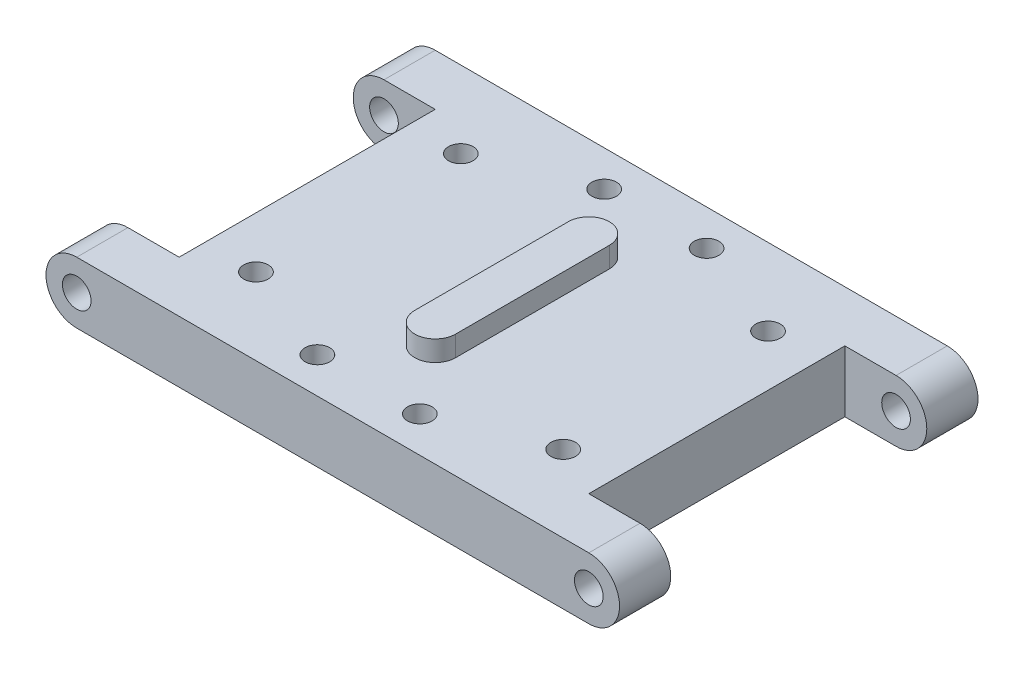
ISO-10303-21;
HEADER;
FILE_DESCRIPTION(('STEP AP214'),'2;1');
FILE_NAME('part.step','',(''),(''),'','','');
FILE_SCHEMA(('AUTOMOTIVE_DESIGN { 1 0 10303 214 1 1 1 1 }'));
ENDSEC;
DATA;
#1=APPLICATION_CONTEXT('core data for automotive mechanical design processes');
#2=APPLICATION_PROTOCOL_DEFINITION('international standard','automotive_design',2000,#1);
#3=PRODUCT_CONTEXT('',#1,'mechanical');
#4=PRODUCT('Part','Part','',(#3));
#5=PRODUCT_RELATED_PRODUCT_CATEGORY('part','',(#4));
#6=PRODUCT_DEFINITION_FORMATION('','',#4);
#7=PRODUCT_DEFINITION_CONTEXT('part definition',#1,'design');
#8=PRODUCT_DEFINITION('design','',#6,#7);
#9=PRODUCT_DEFINITION_SHAPE('','',#8);
#10=(LENGTH_UNIT() NAMED_UNIT(*) SI_UNIT(.MILLI.,.METRE.));
#11=(NAMED_UNIT(*) PLANE_ANGLE_UNIT() SI_UNIT($,.RADIAN.));
#12=(NAMED_UNIT(*) SI_UNIT($,.STERADIAN.) SOLID_ANGLE_UNIT());
#13=UNCERTAINTY_MEASURE_WITH_UNIT(LENGTH_MEASURE(1.E-05),#10,'distance_accuracy_value','');
#14=(GEOMETRIC_REPRESENTATION_CONTEXT(3) GLOBAL_UNCERTAINTY_ASSIGNED_CONTEXT((#13)) GLOBAL_UNIT_ASSIGNED_CONTEXT((#10,
#11,#12)) REPRESENTATION_CONTEXT('',''));
#15=CARTESIAN_POINT('',(0.,0.,0.));
#16=DIRECTION('',(0.,0.,1.));
#17=DIRECTION('',(1.,0.,0.));
#18=AXIS2_PLACEMENT_3D('',#15,#16,#17);
#19=CARTESIAN_POINT('',(-31.75,3.81000000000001,22.225));
#20=DIRECTION('',(0.,-1.,0.));
#21=DIRECTION('',(1.,0.,0.));
#22=AXIS2_PLACEMENT_3D('',#19,#20,#21);
#23=PLANE('',#22);
#24=CARTESIAN_POINT('',(-19.05,3.81000000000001,-12.7));
#25=DIRECTION('',(0.,-1.,0.));
#26=DIRECTION('',(1.,0.,0.));
#27=AXIS2_PLACEMENT_3D('',#24,#25,#26);
#28=CIRCLE('',#27,1.524);
#29=CARTESIAN_POINT('',(-17.526,3.81000000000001,-12.7));
#30=VERTEX_POINT('',#29);
#31=EDGE_CURVE('E869',#30,#30,#28,.T.);
#32=ORIENTED_EDGE('',*,*,#31,.T.);
#33=EDGE_LOOP('',(#32));
#34=FACE_BOUND('',#33,.T.);
#35=CARTESIAN_POINT('',(-19.05,3.81000000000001,12.7));
#36=DIRECTION('',(0.,-1.,0.));
#37=DIRECTION('',(1.,0.,0.));
#38=AXIS2_PLACEMENT_3D('',#35,#36,#37);
#39=CIRCLE('',#38,1.524);
#40=CARTESIAN_POINT('',(-17.526,3.81000000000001,12.7));
#41=VERTEX_POINT('',#40);
#42=EDGE_CURVE('E870',#41,#41,#39,.T.);
#43=ORIENTED_EDGE('',*,*,#42,.T.);
#44=EDGE_LOOP('',(#43));
#45=FACE_BOUND('',#44,.T.);
#46=CARTESIAN_POINT('',(19.05,3.81000000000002,12.7));
#47=DIRECTION('',(0.,-1.,0.));
#48=DIRECTION('',(1.,0.,0.));
#49=AXIS2_PLACEMENT_3D('',#46,#47,#48);
#50=CIRCLE('',#49,1.524);
#51=CARTESIAN_POINT('',(20.574,3.81000000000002,12.7));
#52=VERTEX_POINT('',#51);
#53=EDGE_CURVE('E874',#52,#52,#50,.T.);
#54=ORIENTED_EDGE('',*,*,#53,.T.);
#55=EDGE_LOOP('',(#54));
#56=FACE_BOUND('',#55,.T.);
#57=CARTESIAN_POINT('',(19.05,3.81000000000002,-12.7));
#58=DIRECTION('',(0.,-1.,0.));
#59=DIRECTION('',(1.,0.,0.));
#60=AXIS2_PLACEMENT_3D('',#57,#58,#59);
#61=CIRCLE('',#60,1.524);
#62=CARTESIAN_POINT('',(20.574,3.81000000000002,-12.7));
#63=VERTEX_POINT('',#62);
#64=EDGE_CURVE('E889',#63,#63,#61,.T.);
#65=ORIENTED_EDGE('',*,*,#64,.T.);
#66=EDGE_LOOP('',(#65));
#67=FACE_BOUND('',#66,.T.);
#68=DIRECTION('',(0.,0.,-1.));
#69=VECTOR('',#68,1.);
#70=CARTESIAN_POINT('',(-25.4,3.81000000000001,-15.875));
#71=LINE('',#70,#69);
#72=CARTESIAN_POINT('',(-25.4,3.81000000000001,15.875));
#73=VERTEX_POINT('',#72);
#74=CARTESIAN_POINT('',(-25.4,3.81000000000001,-15.875));
#75=VERTEX_POINT('',#74);
#76=EDGE_CURVE('E343',#73,#75,#71,.T.);
#77=ORIENTED_EDGE('',*,*,#76,.F.);
#78=DIRECTION('',(-1.,0.,0.));
#79=VECTOR('',#78,1.);
#80=CARTESIAN_POINT('',(-31.75,3.81000000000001,15.875));
#81=LINE('',#80,#79);
#82=CARTESIAN_POINT('',(-31.75,3.81000000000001,15.875));
#83=VERTEX_POINT('',#82);
#84=EDGE_CURVE('E11',#73,#83,#81,.T.);
#85=ORIENTED_EDGE('',*,*,#84,.T.);
#86=DIRECTION('',(0.,0.,-1.));
#87=VECTOR('',#86,1.);
#88=CARTESIAN_POINT('',(-31.75,3.81000000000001,22.225));
#89=LINE('',#88,#87);
#90=CARTESIAN_POINT('',(-31.75,3.81000000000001,22.225));
#91=VERTEX_POINT('',#90);
#92=EDGE_CURVE('E403',#91,#83,#89,.T.);
#93=ORIENTED_EDGE('',*,*,#92,.F.);
#94=DIRECTION('',(-1.,0.,0.));
#95=VECTOR('',#94,1.);
#96=CARTESIAN_POINT('',(-31.75,3.81000000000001,22.225));
#97=LINE('',#96,#95);
#98=CARTESIAN_POINT('',(31.75,3.81000000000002,22.225));
#99=VERTEX_POINT('',#98);
#100=EDGE_CURVE('E390',#99,#91,#97,.T.);
#101=ORIENTED_EDGE('',*,*,#100,.F.);
#102=DIRECTION('',(0.,0.,-1.));
#103=VECTOR('',#102,1.);
#104=CARTESIAN_POINT('',(31.75,3.81000000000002,22.225));
#105=LINE('',#104,#103);
#106=CARTESIAN_POINT('',(31.75,3.81000000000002,15.875));
#107=VERTEX_POINT('',#106);
#108=EDGE_CURVE('E407',#99,#107,#105,.T.);
#109=ORIENTED_EDGE('',*,*,#108,.T.);
#110=DIRECTION('',(1.,0.,0.));
#111=VECTOR('',#110,1.);
#112=CARTESIAN_POINT('',(45.72,3.81000000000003,15.875));
#113=LINE('',#112,#111);
#114=CARTESIAN_POINT('',(25.4,3.81000000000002,15.875));
#115=VERTEX_POINT('',#114);
#116=EDGE_CURVE('E357',#115,#107,#113,.T.);
#117=ORIENTED_EDGE('',*,*,#116,.F.);
#118=DIRECTION('',(0.,0.,1.));
#119=VECTOR('',#118,1.);
#120=CARTESIAN_POINT('',(25.4,3.81000000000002,-15.875));
#121=LINE('',#120,#119);
#122=CARTESIAN_POINT('',(25.4,3.81000000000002,-15.875));
#123=VERTEX_POINT('',#122);
#124=EDGE_CURVE('E295',#123,#115,#121,.T.);
#125=ORIENTED_EDGE('',*,*,#124,.F.);
#126=DIRECTION('',(1.,0.,0.));
#127=VECTOR('',#126,1.);
#128=CARTESIAN_POINT('',(-31.75,3.81000000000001,-15.875));
#129=LINE('',#128,#127);
#130=CARTESIAN_POINT('',(31.75,3.81000000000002,-15.875));
#131=VERTEX_POINT('',#130);
#132=EDGE_CURVE('E44',#123,#131,#129,.T.);
#133=ORIENTED_EDGE('',*,*,#132,.T.);
#134=CARTESIAN_POINT('',(31.75,3.81000000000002,-22.225));
#135=VERTEX_POINT('',#134);
#136=EDGE_CURVE('E406',#131,#135,#105,.T.);
#137=ORIENTED_EDGE('',*,*,#136,.T.);
#138=DIRECTION('',(-1.,0.,0.));
#139=VECTOR('',#138,1.);
#140=CARTESIAN_POINT('',(-31.75,3.81000000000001,-22.225));
#141=LINE('',#140,#139);
#142=CARTESIAN_POINT('',(-31.75,3.81000000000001,-22.225));
#143=VERTEX_POINT('',#142);
#144=EDGE_CURVE('E386',#135,#143,#141,.T.);
#145=ORIENTED_EDGE('',*,*,#144,.T.);
#146=CARTESIAN_POINT('',(-31.75,3.81000000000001,-15.875));
#147=VERTEX_POINT('',#146);
#148=EDGE_CURVE('E392',#147,#143,#89,.T.);
#149=ORIENTED_EDGE('',*,*,#148,.F.);
#150=DIRECTION('',(-1.,0.,0.));
#151=VECTOR('',#150,1.);
#152=CARTESIAN_POINT('',(-45.72,3.81000000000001,-15.875));
#153=LINE('',#152,#151);
#154=EDGE_CURVE('E336',#75,#147,#153,.T.);
#155=ORIENTED_EDGE('',*,*,#154,.F.);
#156=EDGE_LOOP('',(#77,#85,#93,#101,#109,#117,#125,#133,#137,#145,#149,#155));
#157=FACE_BOUND('',#156,.T.);
#158=CARTESIAN_POINT('',(-6.35,3.81000000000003,17.78));
#159=DIRECTION('',(0.,-1.,0.));
#160=DIRECTION('',(1.,0.,0.));
#161=AXIS2_PLACEMENT_3D('',#158,#159,#160);
#162=CIRCLE('',#161,1.524);
#163=CARTESIAN_POINT('',(-4.826,3.81000000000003,17.78));
#164=VERTEX_POINT('',#163);
#165=EDGE_CURVE('E262',#164,#164,#162,.T.);
#166=ORIENTED_EDGE('',*,*,#165,.T.);
#167=EDGE_LOOP('',(#166));
#168=FACE_BOUND('',#167,.T.);
#169=CARTESIAN_POINT('',(6.35,3.81000000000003,17.78));
#170=DIRECTION('',(0.,-1.,0.));
#171=DIRECTION('',(1.,0.,0.));
#172=AXIS2_PLACEMENT_3D('',#169,#170,#171);
#173=CIRCLE('',#172,1.524);
#174=CARTESIAN_POINT('',(7.874,3.81000000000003,17.78));
#175=VERTEX_POINT('',#174);
#176=EDGE_CURVE('E244',#175,#175,#173,.T.);
#177=ORIENTED_EDGE('',*,*,#176,.T.);
#178=EDGE_LOOP('',(#177));
#179=FACE_BOUND('',#178,.T.);
#180=CARTESIAN_POINT('',(6.34999999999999,3.81000000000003,-17.78));
#181=DIRECTION('',(0.,-1.,0.));
#182=DIRECTION('',(-1.,0.,0.));
#183=AXIS2_PLACEMENT_3D('',#180,#181,#182);
#184=CIRCLE('',#183,1.524);
#185=CARTESIAN_POINT('',(4.82599999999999,3.81000000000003,-17.78));
#186=VERTEX_POINT('',#185);
#187=EDGE_CURVE('E251',#186,#186,#184,.T.);
#188=ORIENTED_EDGE('',*,*,#187,.T.);
#189=EDGE_LOOP('',(#188));
#190=FACE_BOUND('',#189,.T.);
#191=CARTESIAN_POINT('',(-6.35,3.81000000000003,-17.78));
#192=DIRECTION('',(0.,-1.,0.));
#193=DIRECTION('',(-1.,0.,0.));
#194=AXIS2_PLACEMENT_3D('',#191,#192,#193);
#195=CIRCLE('',#194,1.524);
#196=CARTESIAN_POINT('',(-7.874,3.81000000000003,-17.78));
#197=VERTEX_POINT('',#196);
#198=EDGE_CURVE('E257',#197,#197,#195,.T.);
#199=ORIENTED_EDGE('',*,*,#198,.T.);
#200=EDGE_LOOP('',(#199));
#201=FACE_BOUND('',#200,.T.);
#202=CARTESIAN_POINT('',(0.,3.81000000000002,-9.525));
#203=DIRECTION('',(0.,1.,0.));
#204=DIRECTION('',(-1.,0.,0.));
#205=AXIS2_PLACEMENT_3D('',#202,#203,#204);
#206=CIRCLE('',#205,2.54);
#207=CARTESIAN_POINT('',(2.53999999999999,3.81000000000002,-9.525));
#208=VERTEX_POINT('',#207);
#209=CARTESIAN_POINT('',(-2.54,3.81000000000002,-9.525));
#210=VERTEX_POINT('',#209);
#211=EDGE_CURVE('E218',#208,#210,#206,.T.);
#212=ORIENTED_EDGE('',*,*,#211,.F.);
#213=DIRECTION('',(0.,0.,-1.));
#214=VECTOR('',#213,1.);
#215=CARTESIAN_POINT('',(2.53999999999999,3.81000000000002,-9.525));
#216=LINE('',#215,#214);
#217=CARTESIAN_POINT('',(2.54,3.81000000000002,9.525));
#218=VERTEX_POINT('',#217);
#219=EDGE_CURVE('E215',#218,#208,#216,.T.);
#220=ORIENTED_EDGE('',*,*,#219,.F.);
#221=CARTESIAN_POINT('',(0.,3.81000000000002,9.525));
#222=DIRECTION('',(0.,1.,0.));
#223=DIRECTION('',(-1.,0.,0.));
#224=AXIS2_PLACEMENT_3D('',#221,#222,#223);
#225=CIRCLE('',#224,2.54);
#226=CARTESIAN_POINT('',(-2.53999999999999,3.81000000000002,9.525));
#227=VERTEX_POINT('',#226);
#228=EDGE_CURVE('E57',#227,#218,#225,.T.);
#229=ORIENTED_EDGE('',*,*,#228,.F.);
#230=DIRECTION('',(0.,0.,1.));
#231=VECTOR('',#230,1.);
#232=CARTESIAN_POINT('',(-2.54,3.81000000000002,-9.525));
#233=LINE('',#232,#231);
#234=EDGE_CURVE('E52',#210,#227,#233,.T.);
#235=ORIENTED_EDGE('',*,*,#234,.F.);
#236=EDGE_LOOP('',(#212,#220,#229,#235));
#237=FACE_BOUND('',#236,.T.);
#238=ADVANCED_FACE('F35',(#34,#45,#56,#67,#157,#168,#179,#190,#201,#237),#23,.F.);
#239=CARTESIAN_POINT('',(-31.75,0.,22.225));
#240=DIRECTION('',(0.,0.,-1.));
#241=DIRECTION('',(-1.,0.,0.));
#242=AXIS2_PLACEMENT_3D('',#239,#240,#241);
#243=CYLINDRICAL_SURFACE('',#242,3.81000000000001);
#244=ORIENTED_EDGE('',*,*,#92,.T.);
#245=CARTESIAN_POINT('',(-31.75,0.,15.875));
#246=DIRECTION('',(0.,0.,1.));
#247=DIRECTION('',(1.,0.,0.));
#248=AXIS2_PLACEMENT_3D('',#245,#246,#247);
#249=CIRCLE('',#248,3.81000000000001);
#250=CARTESIAN_POINT('',(-31.75,-3.81000000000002,15.875));
#251=VERTEX_POINT('',#250);
#252=EDGE_CURVE('E378',#83,#251,#249,.T.);
#253=ORIENTED_EDGE('',*,*,#252,.T.);
#254=DIRECTION('',(0.,0.,-1.));
#255=VECTOR('',#254,1.);
#256=CARTESIAN_POINT('',(-31.75,-3.81000000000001,22.225));
#257=LINE('',#256,#255);
#258=CARTESIAN_POINT('',(-31.75,-3.81000000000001,22.225));
#259=VERTEX_POINT('',#258);
#260=EDGE_CURVE('E415',#259,#251,#257,.T.);
#261=ORIENTED_EDGE('',*,*,#260,.F.);
#262=CARTESIAN_POINT('',(-31.75,0.,22.225));
#263=DIRECTION('',(0.,0.,1.));
#264=DIRECTION('',(1.,0.,0.));
#265=AXIS2_PLACEMENT_3D('',#262,#263,#264);
#266=CIRCLE('',#265,3.81000000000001);
#267=EDGE_CURVE('E382',#91,#259,#266,.T.);
#268=ORIENTED_EDGE('',*,*,#267,.F.);
#269=EDGE_LOOP('',(#244,#253,#261,#268));
#270=FACE_BOUND('',#269,.T.);
#271=ADVANCED_FACE('F444',(#270),#243,.T.);
#272=CARTESIAN_POINT('',(31.75,0.,22.225));
#273=DIRECTION('',(0.,0.,-1.));
#274=DIRECTION('',(-1.,0.,0.));
#275=AXIS2_PLACEMENT_3D('',#272,#273,#274);
#276=CYLINDRICAL_SURFACE('',#275,3.81000000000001);
#277=DIRECTION('',(0.,0.,-1.));
#278=VECTOR('',#277,1.);
#279=CARTESIAN_POINT('',(31.75,-3.81000000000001,22.225));
#280=LINE('',#279,#278);
#281=CARTESIAN_POINT('',(31.75,-3.81000000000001,22.225));
#282=VERTEX_POINT('',#281);
#283=CARTESIAN_POINT('',(31.75,-3.81000000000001,15.875));
#284=VERTEX_POINT('',#283);
#285=EDGE_CURVE('E411',#282,#284,#280,.T.);
#286=ORIENTED_EDGE('',*,*,#285,.T.);
#287=CARTESIAN_POINT('',(31.75,0.,15.875));
#288=DIRECTION('',(0.,0.,1.));
#289=DIRECTION('',(1.,0.,0.));
#290=AXIS2_PLACEMENT_3D('',#287,#288,#289);
#291=CIRCLE('',#290,3.81000000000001);
#292=EDGE_CURVE('E372',#284,#107,#291,.T.);
#293=ORIENTED_EDGE('',*,*,#292,.T.);
#294=ORIENTED_EDGE('',*,*,#108,.F.);
#295=CARTESIAN_POINT('',(31.75,0.,22.225));
#296=DIRECTION('',(0.,0.,1.));
#297=DIRECTION('',(1.,0.,0.));
#298=AXIS2_PLACEMENT_3D('',#295,#296,#297);
#299=CIRCLE('',#298,3.81000000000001);
#300=EDGE_CURVE('E388',#282,#99,#299,.T.);
#301=ORIENTED_EDGE('',*,*,#300,.F.);
#302=EDGE_LOOP('',(#286,#293,#294,#301));
#303=FACE_BOUND('',#302,.T.);
#304=ADVANCED_FACE('F452',(#303),#276,.T.);
#305=CARTESIAN_POINT('',(-31.75,-3.81000000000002,-15.875));
#306=VERTEX_POINT('',#305);
#307=CARTESIAN_POINT('',(-31.75,-3.81000000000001,-22.225));
#308=VERTEX_POINT('',#307);
#309=EDGE_CURVE('E414',#306,#308,#257,.T.);
#310=ORIENTED_EDGE('',*,*,#309,.F.);
#311=CARTESIAN_POINT('',(-31.75,0.,-15.875));
#312=DIRECTION('',(0.,0.,-1.));
#313=DIRECTION('',(-1.,0.,0.));
#314=AXIS2_PLACEMENT_3D('',#311,#312,#313);
#315=CIRCLE('',#314,3.81000000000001);
#316=EDGE_CURVE('E375',#306,#147,#315,.T.);
#317=ORIENTED_EDGE('',*,*,#316,.T.);
#318=ORIENTED_EDGE('',*,*,#148,.T.);
#319=CARTESIAN_POINT('',(-31.75,0.,-22.225));
#320=DIRECTION('',(0.,0.,1.));
#321=DIRECTION('',(1.,0.,0.));
#322=AXIS2_PLACEMENT_3D('',#319,#320,#321);
#323=CIRCLE('',#322,3.81000000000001);
#324=EDGE_CURVE('E381',#143,#308,#323,.T.);
#325=ORIENTED_EDGE('',*,*,#324,.T.);
#326=EDGE_LOOP('',(#310,#317,#318,#325));
#327=FACE_BOUND('',#326,.T.);
#328=ADVANCED_FACE('F37',(#327),#243,.T.);
#329=CARTESIAN_POINT('',(-31.75,-3.81000000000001,22.225));
#330=DIRECTION('',(0.,1.,0.));
#331=DIRECTION('',(-1.,0.,0.));
#332=AXIS2_PLACEMENT_3D('',#329,#330,#331);
#333=PLANE('',#332);
#334=CARTESIAN_POINT('',(-19.05,-3.81000000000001,-12.7));
#335=DIRECTION('',(0.,-1.,0.));
#336=DIRECTION('',(-1.,0.,0.));
#337=AXIS2_PLACEMENT_3D('',#334,#335,#336);
#338=CIRCLE('',#337,1.524);
#339=CARTESIAN_POINT('',(-20.574,-3.81000000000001,-12.7));
#340=VERTEX_POINT('',#339);
#341=EDGE_CURVE('E474',#340,#340,#338,.T.);
#342=ORIENTED_EDGE('',*,*,#341,.F.);
#343=EDGE_LOOP('',(#342));
#344=FACE_BOUND('',#343,.T.);
#345=CARTESIAN_POINT('',(-19.05,-3.81000000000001,12.7));
#346=DIRECTION('',(0.,-1.,0.));
#347=DIRECTION('',(-1.,0.,0.));
#348=AXIS2_PLACEMENT_3D('',#345,#346,#347);
#349=CIRCLE('',#348,1.524);
#350=CARTESIAN_POINT('',(-20.574,-3.81000000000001,12.7));
#351=VERTEX_POINT('',#350);
#352=EDGE_CURVE('E478',#351,#351,#349,.T.);
#353=ORIENTED_EDGE('',*,*,#352,.F.);
#354=EDGE_LOOP('',(#353));
#355=FACE_BOUND('',#354,.T.);
#356=CARTESIAN_POINT('',(19.05,-3.81,12.7));
#357=DIRECTION('',(0.,-1.,0.));
#358=DIRECTION('',(1.,0.,0.));
#359=AXIS2_PLACEMENT_3D('',#356,#357,#358);
#360=CIRCLE('',#359,1.524);
#361=CARTESIAN_POINT('',(20.574,-3.81,12.7));
#362=VERTEX_POINT('',#361);
#363=EDGE_CURVE('E482',#362,#362,#360,.T.);
#364=ORIENTED_EDGE('',*,*,#363,.F.);
#365=EDGE_LOOP('',(#364));
#366=FACE_BOUND('',#365,.T.);
#367=CARTESIAN_POINT('',(19.05,-3.81,-12.7));
#368=DIRECTION('',(0.,-1.,0.));
#369=DIRECTION('',(1.,0.,0.));
#370=AXIS2_PLACEMENT_3D('',#367,#368,#369);
#371=CIRCLE('',#370,1.524);
#372=CARTESIAN_POINT('',(20.574,-3.81,-12.7));
#373=VERTEX_POINT('',#372);
#374=EDGE_CURVE('E486',#373,#373,#371,.T.);
#375=ORIENTED_EDGE('',*,*,#374,.F.);
#376=EDGE_LOOP('',(#375));
#377=FACE_BOUND('',#376,.T.);
#378=DIRECTION('',(1.,0.,0.));
#379=VECTOR('',#378,1.);
#380=CARTESIAN_POINT('',(-6.35,-3.81000000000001,15.24));
#381=LINE('',#380,#379);
#382=CARTESIAN_POINT('',(-6.35,-3.81000000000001,15.24));
#383=VERTEX_POINT('',#382);
#384=CARTESIAN_POINT('',(6.35,-3.81,15.24));
#385=VERTEX_POINT('',#384);
#386=EDGE_CURVE('E284',#383,#385,#381,.T.);
#387=ORIENTED_EDGE('',*,*,#386,.F.);
#388=CARTESIAN_POINT('',(-6.35,-3.81000000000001,17.78));
#389=DIRECTION('',(0.,-1.,0.));
#390=DIRECTION('',(1.,0.,0.));
#391=AXIS2_PLACEMENT_3D('',#388,#389,#390);
#392=CIRCLE('',#391,2.54000000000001);
#393=CARTESIAN_POINT('',(-6.35,-3.81000000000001,20.32));
#394=VERTEX_POINT('',#393);
#395=EDGE_CURVE('E282',#394,#383,#392,.T.);
#396=ORIENTED_EDGE('',*,*,#395,.F.);
#397=DIRECTION('',(-1.,0.,0.));
#398=VECTOR('',#397,1.);
#399=CARTESIAN_POINT('',(-6.35,-3.81000000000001,20.32));
#400=LINE('',#399,#398);
#401=CARTESIAN_POINT('',(6.35,-3.81,20.32));
#402=VERTEX_POINT('',#401);
#403=EDGE_CURVE('E272',#402,#394,#400,.T.);
#404=ORIENTED_EDGE('',*,*,#403,.F.);
#405=CARTESIAN_POINT('',(6.35,-3.81,17.78));
#406=DIRECTION('',(0.,-1.,0.));
#407=DIRECTION('',(1.,0.,0.));
#408=AXIS2_PLACEMENT_3D('',#405,#406,#407);
#409=CIRCLE('',#408,2.54000000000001);
#410=EDGE_CURVE('E288',#385,#402,#409,.T.);
#411=ORIENTED_EDGE('',*,*,#410,.F.);
#412=EDGE_LOOP('',(#387,#396,#404,#411));
#413=FACE_BOUND('',#412,.T.);
#414=DIRECTION('',(1.,0.,0.));
#415=VECTOR('',#414,1.);
#416=CARTESIAN_POINT('',(-6.34999999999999,-3.81000000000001,-20.32));
#417=LINE('',#416,#415);
#418=CARTESIAN_POINT('',(-6.34999999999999,-3.81000000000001,-20.32));
#419=VERTEX_POINT('',#418);
#420=CARTESIAN_POINT('',(6.35000000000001,-3.81,-20.32));
#421=VERTEX_POINT('',#420);
#422=EDGE_CURVE('E317',#419,#421,#417,.T.);
#423=ORIENTED_EDGE('',*,*,#422,.F.);
#424=CARTESIAN_POINT('',(-6.34999999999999,-3.81000000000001,-17.78));
#425=DIRECTION('',(0.,-1.,0.));
#426=DIRECTION('',(1.,0.,0.));
#427=AXIS2_PLACEMENT_3D('',#424,#425,#426);
#428=CIRCLE('',#427,2.54);
#429=CARTESIAN_POINT('',(-6.34999999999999,-3.81000000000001,-15.24));
#430=VERTEX_POINT('',#429);
#431=EDGE_CURVE('E265',#430,#419,#428,.T.);
#432=ORIENTED_EDGE('',*,*,#431,.F.);
#433=DIRECTION('',(-1.,0.,0.));
#434=VECTOR('',#433,1.);
#435=CARTESIAN_POINT('',(-6.34999999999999,-3.81000000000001,-15.24));
#436=LINE('',#435,#434);
#437=CARTESIAN_POINT('',(6.35000000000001,-3.81,-15.24));
#438=VERTEX_POINT('',#437);
#439=EDGE_CURVE('E306',#438,#430,#436,.T.);
#440=ORIENTED_EDGE('',*,*,#439,.F.);
#441=CARTESIAN_POINT('',(6.35000000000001,-3.81,-17.78));
#442=DIRECTION('',(0.,-1.,0.));
#443=DIRECTION('',(1.,0.,0.));
#444=AXIS2_PLACEMENT_3D('',#441,#442,#443);
#445=CIRCLE('',#444,2.54);
#446=EDGE_CURVE('E320',#421,#438,#445,.T.);
#447=ORIENTED_EDGE('',*,*,#446,.F.);
#448=EDGE_LOOP('',(#423,#432,#440,#447));
#449=FACE_BOUND('',#448,.T.);
#450=ORIENTED_EDGE('',*,*,#260,.T.);
#451=DIRECTION('',(1.,0.,0.));
#452=VECTOR('',#451,1.);
#453=CARTESIAN_POINT('',(-45.72,-3.81000000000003,15.875));
#454=LINE('',#453,#452);
#455=CARTESIAN_POINT('',(-25.4,-3.81000000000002,15.875));
#456=VERTEX_POINT('',#455);
#457=EDGE_CURVE('E339',#251,#456,#454,.T.);
#458=ORIENTED_EDGE('',*,*,#457,.T.);
#459=DIRECTION('',(0.,0.,-1.));
#460=VECTOR('',#459,1.);
#461=CARTESIAN_POINT('',(-25.4,-3.81000000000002,-15.875));
#462=LINE('',#461,#460);
#463=CARTESIAN_POINT('',(-25.4,-3.81000000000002,-15.875));
#464=VERTEX_POINT('',#463);
#465=EDGE_CURVE('E332',#456,#464,#462,.T.);
#466=ORIENTED_EDGE('',*,*,#465,.T.);
#467=DIRECTION('',(-1.,0.,0.));
#468=VECTOR('',#467,1.);
#469=CARTESIAN_POINT('',(-45.72,-3.81000000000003,-15.875));
#470=LINE('',#469,#468);
#471=EDGE_CURVE('E335',#464,#306,#470,.T.);
#472=ORIENTED_EDGE('',*,*,#471,.T.);
#473=ORIENTED_EDGE('',*,*,#309,.T.);
#474=DIRECTION('',(1.,0.,0.));
#475=VECTOR('',#474,1.);
#476=CARTESIAN_POINT('',(-31.75,-3.81000000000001,-22.225));
#477=LINE('',#476,#475);
#478=CARTESIAN_POINT('',(31.75,-3.81000000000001,-22.225));
#479=VERTEX_POINT('',#478);
#480=EDGE_CURVE('E395',#308,#479,#477,.T.);
#481=ORIENTED_EDGE('',*,*,#480,.T.);
#482=CARTESIAN_POINT('',(31.75,-3.81000000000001,-15.875));
#483=VERTEX_POINT('',#482);
#484=EDGE_CURVE('E410',#483,#479,#280,.T.);
#485=ORIENTED_EDGE('',*,*,#484,.F.);
#486=DIRECTION('',(-1.,0.,0.));
#487=VECTOR('',#486,1.);
#488=CARTESIAN_POINT('',(45.72,-3.81000000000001,-15.875));
#489=LINE('',#488,#487);
#490=CARTESIAN_POINT('',(25.4,-3.81000000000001,-15.875));
#491=VERTEX_POINT('',#490);
#492=EDGE_CURVE('E353',#483,#491,#489,.T.);
#493=ORIENTED_EDGE('',*,*,#492,.T.);
#494=DIRECTION('',(0.,0.,1.));
#495=VECTOR('',#494,1.);
#496=CARTESIAN_POINT('',(25.4,-3.81000000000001,-15.875));
#497=LINE('',#496,#495);
#498=CARTESIAN_POINT('',(25.4,-3.81000000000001,15.875));
#499=VERTEX_POINT('',#498);
#500=EDGE_CURVE('E356',#491,#499,#497,.T.);
#501=ORIENTED_EDGE('',*,*,#500,.T.);
#502=DIRECTION('',(1.,0.,0.));
#503=VECTOR('',#502,1.);
#504=CARTESIAN_POINT('',(45.72,-3.81000000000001,15.875));
#505=LINE('',#504,#503);
#506=EDGE_CURVE('E360',#499,#284,#505,.T.);
#507=ORIENTED_EDGE('',*,*,#506,.T.);
#508=ORIENTED_EDGE('',*,*,#285,.F.);
#509=DIRECTION('',(1.,0.,0.));
#510=VECTOR('',#509,1.);
#511=CARTESIAN_POINT('',(-31.75,-3.81000000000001,22.225));
#512=LINE('',#511,#510);
#513=EDGE_CURVE('E385',#259,#282,#512,.T.);
#514=ORIENTED_EDGE('',*,*,#513,.F.);
#515=EDGE_LOOP('',(#450,#458,#466,#472,#473,#481,#485,#493,#501,#507,#508,#514));
#516=FACE_BOUND('',#515,.T.);
#517=ADVANCED_FACE('F463',(#344,#355,#366,#377,#413,#449,#516),#333,.F.);
#518=ORIENTED_EDGE('',*,*,#136,.F.);
#519=CARTESIAN_POINT('',(31.75,0.,-15.875));
#520=DIRECTION('',(0.,0.,-1.));
#521=DIRECTION('',(-1.,0.,0.));
#522=AXIS2_PLACEMENT_3D('',#519,#520,#521);
#523=CIRCLE('',#522,3.81000000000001);
#524=EDGE_CURVE('E350',#131,#483,#523,.T.);
#525=ORIENTED_EDGE('',*,*,#524,.T.);
#526=ORIENTED_EDGE('',*,*,#484,.T.);
#527=CARTESIAN_POINT('',(31.75,0.,-22.225));
#528=DIRECTION('',(0.,0.,1.));
#529=DIRECTION('',(1.,0.,0.));
#530=AXIS2_PLACEMENT_3D('',#527,#528,#529);
#531=CIRCLE('',#530,3.81000000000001);
#532=EDGE_CURVE('E398',#479,#135,#531,.T.);
#533=ORIENTED_EDGE('',*,*,#532,.T.);
#534=EDGE_LOOP('',(#518,#525,#526,#533));
#535=FACE_BOUND('',#534,.T.);
#536=ADVANCED_FACE('F460',(#535),#276,.T.);
#537=CARTESIAN_POINT('',(-31.75,0.,22.225));
#538=DIRECTION('',(0.,0.,1.));
#539=DIRECTION('',(1.,0.,0.));
#540=AXIS2_PLACEMENT_3D('',#537,#538,#539);
#541=PLANE('',#540);
#542=CARTESIAN_POINT('',(-31.75,0.,22.225));
#543=DIRECTION('',(0.,0.,1.));
#544=DIRECTION('',(1.,0.,0.));
#545=AXIS2_PLACEMENT_3D('',#542,#543,#544);
#546=CIRCLE('',#545,1.778);
#547=CARTESIAN_POINT('',(-29.972,0.,22.225));
#548=VERTEX_POINT('',#547);
#549=EDGE_CURVE('E232',#548,#548,#546,.T.);
#550=ORIENTED_EDGE('',*,*,#549,.F.);
#551=EDGE_LOOP('',(#550));
#552=FACE_BOUND('',#551,.T.);
#553=CARTESIAN_POINT('',(31.75,0.,22.225));
#554=DIRECTION('',(0.,0.,1.));
#555=DIRECTION('',(1.,0.,0.));
#556=AXIS2_PLACEMENT_3D('',#553,#554,#555);
#557=CIRCLE('',#556,1.778);
#558=CARTESIAN_POINT('',(33.528,0.,22.225));
#559=VERTEX_POINT('',#558);
#560=EDGE_CURVE('E219',#559,#559,#557,.T.);
#561=ORIENTED_EDGE('',*,*,#560,.F.);
#562=EDGE_LOOP('',(#561));
#563=FACE_BOUND('',#562,.T.);
#564=ORIENTED_EDGE('',*,*,#267,.T.);
#565=ORIENTED_EDGE('',*,*,#513,.T.);
#566=ORIENTED_EDGE('',*,*,#300,.T.);
#567=ORIENTED_EDGE('',*,*,#100,.T.);
#568=EDGE_LOOP('',(#564,#565,#566,#567));
#569=FACE_BOUND('',#568,.T.);
#570=ADVANCED_FACE('F462',(#552,#563,#569),#541,.T.);
#571=CARTESIAN_POINT('',(-31.75,0.,-22.225));
#572=DIRECTION('',(0.,0.,1.));
#573=DIRECTION('',(1.,0.,0.));
#574=AXIS2_PLACEMENT_3D('',#571,#572,#573);
#575=PLANE('',#574);
#576=CARTESIAN_POINT('',(-31.75,0.,-22.225));
#577=DIRECTION('',(0.,0.,1.));
#578=DIRECTION('',(1.,0.,0.));
#579=AXIS2_PLACEMENT_3D('',#576,#577,#578);
#580=CIRCLE('',#579,1.778);
#581=CARTESIAN_POINT('',(-29.972,0.,-22.225));
#582=VERTEX_POINT('',#581);
#583=EDGE_CURVE('E228',#582,#582,#580,.T.);
#584=ORIENTED_EDGE('',*,*,#583,.T.);
#585=EDGE_LOOP('',(#584));
#586=FACE_BOUND('',#585,.T.);
#587=CARTESIAN_POINT('',(31.75,0.,-22.225));
#588=DIRECTION('',(0.,0.,1.));
#589=DIRECTION('',(1.,0.,0.));
#590=AXIS2_PLACEMENT_3D('',#587,#588,#589);
#591=CIRCLE('',#590,1.778);
#592=CARTESIAN_POINT('',(33.528,0.,-22.225));
#593=VERTEX_POINT('',#592);
#594=EDGE_CURVE('E222',#593,#593,#591,.T.);
#595=ORIENTED_EDGE('',*,*,#594,.T.);
#596=EDGE_LOOP('',(#595));
#597=FACE_BOUND('',#596,.T.);
#598=ORIENTED_EDGE('',*,*,#324,.F.);
#599=ORIENTED_EDGE('',*,*,#144,.F.);
#600=ORIENTED_EDGE('',*,*,#532,.F.);
#601=ORIENTED_EDGE('',*,*,#480,.F.);
#602=EDGE_LOOP('',(#598,#599,#600,#601));
#603=FACE_BOUND('',#602,.T.);
#604=ADVANCED_FACE('F458',(#586,#597,#603),#575,.F.);
#605=CARTESIAN_POINT('',(45.72,-3.81000000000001,15.875));
#606=DIRECTION('',(0.,0.,1.));
#607=DIRECTION('',(1.,0.,0.));
#608=AXIS2_PLACEMENT_3D('',#605,#606,#607);
#609=PLANE('',#608);
#610=CARTESIAN_POINT('',(31.75,0.,15.875));
#611=DIRECTION('',(0.,0.,1.));
#612=DIRECTION('',(1.,0.,0.));
#613=AXIS2_PLACEMENT_3D('',#610,#611,#612);
#614=CIRCLE('',#613,1.778);
#615=CARTESIAN_POINT('',(33.528,0.,15.875));
#616=VERTEX_POINT('',#615);
#617=EDGE_CURVE('E240',#616,#616,#614,.T.);
#618=ORIENTED_EDGE('',*,*,#617,.T.);
#619=EDGE_LOOP('',(#618));
#620=FACE_BOUND('',#619,.T.);
#621=ORIENTED_EDGE('',*,*,#506,.F.);
#622=DIRECTION('',(0.,1.,0.));
#623=VECTOR('',#622,1.);
#624=CARTESIAN_POINT('',(25.4,-3.81000000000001,15.875));
#625=LINE('',#624,#623);
#626=EDGE_CURVE('E345',#499,#115,#625,.T.);
#627=ORIENTED_EDGE('',*,*,#626,.T.);
#628=ORIENTED_EDGE('',*,*,#116,.T.);
#629=ORIENTED_EDGE('',*,*,#292,.F.);
#630=EDGE_LOOP('',(#621,#627,#628,#629));
#631=FACE_BOUND('',#630,.T.);
#632=ADVANCED_FACE('F538',(#620,#631),#609,.F.);
#633=CARTESIAN_POINT('',(45.72,-3.81000000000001,-15.875));
#634=DIRECTION('',(0.,0.,-1.));
#635=DIRECTION('',(-1.,0.,0.));
#636=AXIS2_PLACEMENT_3D('',#633,#634,#635);
#637=PLANE('',#636);
#638=CARTESIAN_POINT('',(31.75,0.,-15.875));
#639=DIRECTION('',(0.,0.,-1.));
#640=DIRECTION('',(-1.,0.,0.));
#641=AXIS2_PLACEMENT_3D('',#638,#639,#640);
#642=CIRCLE('',#641,1.778);
#643=CARTESIAN_POINT('',(29.972,0.,-15.875));
#644=VERTEX_POINT('',#643);
#645=EDGE_CURVE('E39',#644,#644,#642,.T.);
#646=ORIENTED_EDGE('',*,*,#645,.T.);
#647=EDGE_LOOP('',(#646));
#648=FACE_BOUND('',#647,.T.);
#649=ORIENTED_EDGE('',*,*,#132,.F.);
#650=DIRECTION('',(0.,1.,0.));
#651=VECTOR('',#650,1.);
#652=CARTESIAN_POINT('',(25.4,-3.81000000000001,-15.875));
#653=LINE('',#652,#651);
#654=EDGE_CURVE('E363',#491,#123,#653,.T.);
#655=ORIENTED_EDGE('',*,*,#654,.F.);
#656=ORIENTED_EDGE('',*,*,#492,.F.);
#657=ORIENTED_EDGE('',*,*,#524,.F.);
#658=EDGE_LOOP('',(#649,#655,#656,#657));
#659=FACE_BOUND('',#658,.T.);
#660=ADVANCED_FACE('F520',(#648,#659),#637,.F.);
#661=CARTESIAN_POINT('',(25.4,-3.81000000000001,-15.875));
#662=DIRECTION('',(-1.,0.,0.));
#663=DIRECTION('',(0.,-1.,0.));
#664=AXIS2_PLACEMENT_3D('',#661,#662,#663);
#665=PLANE('',#664);
#666=ORIENTED_EDGE('',*,*,#124,.T.);
#667=ORIENTED_EDGE('',*,*,#626,.F.);
#668=ORIENTED_EDGE('',*,*,#500,.F.);
#669=ORIENTED_EDGE('',*,*,#654,.T.);
#670=EDGE_LOOP('',(#666,#667,#668,#669));
#671=FACE_BOUND('',#670,.T.);
#672=ADVANCED_FACE('F524',(#671),#665,.F.);
#673=CARTESIAN_POINT('',(-45.72,-3.81000000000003,15.875));
#674=DIRECTION('',(0.,0.,1.));
#675=DIRECTION('',(1.,0.,0.));
#676=AXIS2_PLACEMENT_3D('',#673,#674,#675);
#677=PLANE('',#676);
#678=CARTESIAN_POINT('',(-31.75,0.,15.875));
#679=DIRECTION('',(0.,0.,1.));
#680=DIRECTION('',(1.,0.,0.));
#681=AXIS2_PLACEMENT_3D('',#678,#679,#680);
#682=CIRCLE('',#681,1.778);
#683=CARTESIAN_POINT('',(-29.972,0.,15.875));
#684=VERTEX_POINT('',#683);
#685=EDGE_CURVE('E237',#684,#684,#682,.T.);
#686=ORIENTED_EDGE('',*,*,#685,.T.);
#687=EDGE_LOOP('',(#686));
#688=FACE_BOUND('',#687,.T.);
#689=ORIENTED_EDGE('',*,*,#84,.F.);
#690=DIRECTION('',(0.,1.,0.));
#691=VECTOR('',#690,1.);
#692=CARTESIAN_POINT('',(-25.4,-3.81000000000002,15.875));
#693=LINE('',#692,#691);
#694=EDGE_CURVE('E347',#456,#73,#693,.T.);
#695=ORIENTED_EDGE('',*,*,#694,.F.);
#696=ORIENTED_EDGE('',*,*,#457,.F.);
#697=ORIENTED_EDGE('',*,*,#252,.F.);
#698=EDGE_LOOP('',(#689,#695,#696,#697));
#699=FACE_BOUND('',#698,.T.);
#700=ADVANCED_FACE('F500',(#688,#699),#677,.F.);
#701=CARTESIAN_POINT('',(-45.72,-3.81000000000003,-15.875));
#702=DIRECTION('',(0.,0.,-1.));
#703=DIRECTION('',(-1.,0.,0.));
#704=AXIS2_PLACEMENT_3D('',#701,#702,#703);
#705=PLANE('',#704);
#706=CARTESIAN_POINT('',(-31.75,0.,-15.875));
#707=DIRECTION('',(0.,0.,-1.));
#708=DIRECTION('',(-1.,0.,0.));
#709=AXIS2_PLACEMENT_3D('',#706,#707,#708);
#710=CIRCLE('',#709,1.778);
#711=CARTESIAN_POINT('',(-33.528,0.,-15.875));
#712=VERTEX_POINT('',#711);
#713=EDGE_CURVE('E231',#712,#712,#710,.T.);
#714=ORIENTED_EDGE('',*,*,#713,.T.);
#715=EDGE_LOOP('',(#714));
#716=FACE_BOUND('',#715,.T.);
#717=ORIENTED_EDGE('',*,*,#471,.F.);
#718=DIRECTION('',(0.,1.,0.));
#719=VECTOR('',#718,1.);
#720=CARTESIAN_POINT('',(-25.4,-3.81000000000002,-15.875));
#721=LINE('',#720,#719);
#722=EDGE_CURVE('E342',#464,#75,#721,.T.);
#723=ORIENTED_EDGE('',*,*,#722,.T.);
#724=ORIENTED_EDGE('',*,*,#154,.T.);
#725=ORIENTED_EDGE('',*,*,#316,.F.);
#726=EDGE_LOOP('',(#717,#723,#724,#725));
#727=FACE_BOUND('',#726,.T.);
#728=ADVANCED_FACE('F422',(#716,#727),#705,.F.);
#729=CARTESIAN_POINT('',(-25.4,-3.81000000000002,-15.875));
#730=DIRECTION('',(1.,0.,0.));
#731=DIRECTION('',(0.,1.,0.));
#732=AXIS2_PLACEMENT_3D('',#729,#730,#731);
#733=PLANE('',#732);
#734=ORIENTED_EDGE('',*,*,#76,.T.);
#735=ORIENTED_EDGE('',*,*,#722,.F.);
#736=ORIENTED_EDGE('',*,*,#465,.F.);
#737=ORIENTED_EDGE('',*,*,#694,.T.);
#738=EDGE_LOOP('',(#734,#735,#736,#737));
#739=FACE_BOUND('',#738,.T.);
#740=ADVANCED_FACE('F508',(#739),#733,.F.);
#741=CARTESIAN_POINT('',(-6.34999999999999,-1.27000000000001,-17.78));
#742=DIRECTION('',(0.,-1.,0.));
#743=DIRECTION('',(1.,0.,0.));
#744=AXIS2_PLACEMENT_3D('',#741,#742,#743);
#745=CYLINDRICAL_SURFACE('',#744,2.54);
#746=ORIENTED_EDGE('',*,*,#431,.T.);
#747=DIRECTION('',(0.,-1.,0.));
#748=VECTOR('',#747,1.);
#749=CARTESIAN_POINT('',(-6.34999999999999,-1.27000000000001,-20.32));
#750=LINE('',#749,#748);
#751=CARTESIAN_POINT('',(-6.34999999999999,-1.27000000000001,-20.32));
#752=VERTEX_POINT('',#751);
#753=EDGE_CURVE('E315',#752,#419,#750,.T.);
#754=ORIENTED_EDGE('',*,*,#753,.F.);
#755=CARTESIAN_POINT('',(-6.34999999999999,-1.27000000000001,-17.78));
#756=DIRECTION('',(0.,-1.,0.));
#757=DIRECTION('',(1.,0.,0.));
#758=AXIS2_PLACEMENT_3D('',#755,#756,#757);
#759=CIRCLE('',#758,2.54);
#760=CARTESIAN_POINT('',(-6.34999999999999,-1.27000000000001,-15.24));
#761=VERTEX_POINT('',#760);
#762=EDGE_CURVE('E302',#761,#752,#759,.T.);
#763=ORIENTED_EDGE('',*,*,#762,.F.);
#764=DIRECTION('',(0.,-1.,0.));
#765=VECTOR('',#764,1.);
#766=CARTESIAN_POINT('',(-6.34999999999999,-1.27000000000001,-15.24));
#767=LINE('',#766,#765);
#768=EDGE_CURVE('E285',#761,#430,#767,.T.);
#769=ORIENTED_EDGE('',*,*,#768,.T.);
#770=EDGE_LOOP('',(#746,#754,#763,#769));
#771=FACE_BOUND('',#770,.T.);
#772=ADVANCED_FACE('F553',(#771),#745,.F.);
#773=CARTESIAN_POINT('',(-6.34999999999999,-1.27000000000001,-15.24));
#774=DIRECTION('',(0.,0.,1.));
#775=DIRECTION('',(1.,0.,0.));
#776=AXIS2_PLACEMENT_3D('',#773,#774,#775);
#777=PLANE('',#776);
#778=ORIENTED_EDGE('',*,*,#439,.T.);
#779=ORIENTED_EDGE('',*,*,#768,.F.);
#780=DIRECTION('',(-1.,0.,0.));
#781=VECTOR('',#780,1.);
#782=CARTESIAN_POINT('',(-6.34999999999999,-1.27000000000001,-15.24));
#783=LINE('',#782,#781);
#784=CARTESIAN_POINT('',(6.35000000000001,-1.27,-15.24));
#785=VERTEX_POINT('',#784);
#786=EDGE_CURVE('E312',#785,#761,#783,.T.);
#787=ORIENTED_EDGE('',*,*,#786,.F.);
#788=DIRECTION('',(0.,-1.,0.));
#789=VECTOR('',#788,1.);
#790=CARTESIAN_POINT('',(6.35000000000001,-1.27,-15.24));
#791=LINE('',#790,#789);
#792=EDGE_CURVE('E326',#785,#438,#791,.T.);
#793=ORIENTED_EDGE('',*,*,#792,.T.);
#794=EDGE_LOOP('',(#778,#779,#787,#793));
#795=FACE_BOUND('',#794,.T.);
#796=ADVANCED_FACE('F561',(#795),#777,.F.);
#797=CARTESIAN_POINT('',(6.35000000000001,-1.27,-17.78));
#798=DIRECTION('',(0.,-1.,0.));
#799=DIRECTION('',(1.,0.,0.));
#800=AXIS2_PLACEMENT_3D('',#797,#798,#799);
#801=CYLINDRICAL_SURFACE('',#800,2.54);
#802=ORIENTED_EDGE('',*,*,#446,.T.);
#803=ORIENTED_EDGE('',*,*,#792,.F.);
#804=CARTESIAN_POINT('',(6.35000000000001,-1.27,-17.78));
#805=DIRECTION('',(0.,-1.,0.));
#806=DIRECTION('',(1.,0.,0.));
#807=AXIS2_PLACEMENT_3D('',#804,#805,#806);
#808=CIRCLE('',#807,2.54);
#809=CARTESIAN_POINT('',(6.35,-1.27,-20.32));
#810=VERTEX_POINT('',#809);
#811=EDGE_CURVE('E309',#810,#785,#808,.T.);
#812=ORIENTED_EDGE('',*,*,#811,.F.);
#813=DIRECTION('',(0.,-1.,0.));
#814=VECTOR('',#813,1.);
#815=CARTESIAN_POINT('',(6.35,-1.27,-20.32));
#816=LINE('',#815,#814);
#817=EDGE_CURVE('E328',#810,#421,#816,.T.);
#818=ORIENTED_EDGE('',*,*,#817,.T.);
#819=EDGE_LOOP('',(#802,#803,#812,#818));
#820=FACE_BOUND('',#819,.T.);
#821=ADVANCED_FACE('F567',(#820),#801,.F.);
#822=CARTESIAN_POINT('',(-6.34999999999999,-1.27000000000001,-20.32));
#823=DIRECTION('',(0.,0.,-1.));
#824=DIRECTION('',(-1.,0.,0.));
#825=AXIS2_PLACEMENT_3D('',#822,#823,#824);
#826=PLANE('',#825);
#827=ORIENTED_EDGE('',*,*,#422,.T.);
#828=ORIENTED_EDGE('',*,*,#817,.F.);
#829=DIRECTION('',(1.,0.,0.));
#830=VECTOR('',#829,1.);
#831=CARTESIAN_POINT('',(-6.34999999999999,-1.27000000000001,-20.32));
#832=LINE('',#831,#830);
#833=EDGE_CURVE('E305',#752,#810,#832,.T.);
#834=ORIENTED_EDGE('',*,*,#833,.F.);
#835=ORIENTED_EDGE('',*,*,#753,.T.);
#836=EDGE_LOOP('',(#827,#828,#834,#835));
#837=FACE_BOUND('',#836,.T.);
#838=ADVANCED_FACE('F563',(#837),#826,.F.);
#839=CARTESIAN_POINT('',(-6.34999999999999,-1.27000000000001,-17.78));
#840=DIRECTION('',(0.,-1.,0.));
#841=DIRECTION('',(1.,0.,0.));
#842=AXIS2_PLACEMENT_3D('',#839,#840,#841);
#843=PLANE('',#842);
#844=CARTESIAN_POINT('',(-6.35,-1.27000000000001,-17.78));
#845=DIRECTION('',(0.,-1.,0.));
#846=DIRECTION('',(-1.,0.,0.));
#847=AXIS2_PLACEMENT_3D('',#844,#845,#846);
#848=CIRCLE('',#847,1.524);
#849=CARTESIAN_POINT('',(-7.874,-1.27000000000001,-17.78));
#850=VERTEX_POINT('',#849);
#851=EDGE_CURVE('E243',#850,#850,#848,.T.);
#852=ORIENTED_EDGE('',*,*,#851,.F.);
#853=EDGE_LOOP('',(#852));
#854=FACE_BOUND('',#853,.T.);
#855=CARTESIAN_POINT('',(6.34999999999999,-1.27,-17.78));
#856=DIRECTION('',(0.,-1.,0.));
#857=DIRECTION('',(-1.,0.,0.));
#858=AXIS2_PLACEMENT_3D('',#855,#856,#857);
#859=CIRCLE('',#858,1.524);
#860=CARTESIAN_POINT('',(4.82599999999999,-1.27,-17.78));
#861=VERTEX_POINT('',#860);
#862=EDGE_CURVE('E254',#861,#861,#859,.T.);
#863=ORIENTED_EDGE('',*,*,#862,.F.);
#864=EDGE_LOOP('',(#863));
#865=FACE_BOUND('',#864,.T.);
#866=ORIENTED_EDGE('',*,*,#762,.T.);
#867=ORIENTED_EDGE('',*,*,#833,.T.);
#868=ORIENTED_EDGE('',*,*,#811,.T.);
#869=ORIENTED_EDGE('',*,*,#786,.T.);
#870=EDGE_LOOP('',(#866,#867,#868,#869));
#871=FACE_BOUND('',#870,.T.);
#872=ADVANCED_FACE('F566',(#854,#865,#871),#843,.T.);
#873=CARTESIAN_POINT('',(-6.35,-1.27000000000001,17.78));
#874=DIRECTION('',(0.,-1.,0.));
#875=DIRECTION('',(1.,0.,0.));
#876=AXIS2_PLACEMENT_3D('',#873,#874,#875);
#877=CYLINDRICAL_SURFACE('',#876,2.54000000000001);
#878=ORIENTED_EDGE('',*,*,#395,.T.);
#879=DIRECTION('',(0.,-1.,0.));
#880=VECTOR('',#879,1.);
#881=CARTESIAN_POINT('',(-6.35,-1.27000000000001,15.24));
#882=LINE('',#881,#880);
#883=CARTESIAN_POINT('',(-6.35,-1.27000000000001,15.24));
#884=VERTEX_POINT('',#883);
#885=EDGE_CURVE('E281',#884,#383,#882,.T.);
#886=ORIENTED_EDGE('',*,*,#885,.F.);
#887=CARTESIAN_POINT('',(-6.35,-1.27000000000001,17.78));
#888=DIRECTION('',(0.,-1.,0.));
#889=DIRECTION('',(1.,0.,0.));
#890=AXIS2_PLACEMENT_3D('',#887,#888,#889);
#891=CIRCLE('',#890,2.54000000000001);
#892=CARTESIAN_POINT('',(-6.35,-1.27000000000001,20.32));
#893=VERTEX_POINT('',#892);
#894=EDGE_CURVE('E268',#893,#884,#891,.T.);
#895=ORIENTED_EDGE('',*,*,#894,.F.);
#896=DIRECTION('',(0.,-1.,0.));
#897=VECTOR('',#896,1.);
#898=CARTESIAN_POINT('',(-6.35,-1.27000000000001,20.32));
#899=LINE('',#898,#897);
#900=EDGE_CURVE('E293',#893,#394,#899,.T.);
#901=ORIENTED_EDGE('',*,*,#900,.T.);
#902=EDGE_LOOP('',(#878,#886,#895,#901));
#903=FACE_BOUND('',#902,.T.);
#904=ADVANCED_FACE('F577',(#903),#877,.F.);
#905=CARTESIAN_POINT('',(-6.35,-1.27000000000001,20.32));
#906=DIRECTION('',(0.,0.,1.));
#907=DIRECTION('',(1.,0.,0.));
#908=AXIS2_PLACEMENT_3D('',#905,#906,#907);
#909=PLANE('',#908);
#910=ORIENTED_EDGE('',*,*,#403,.T.);
#911=ORIENTED_EDGE('',*,*,#900,.F.);
#912=DIRECTION('',(-1.,0.,0.));
#913=VECTOR('',#912,1.);
#914=CARTESIAN_POINT('',(-6.35,-1.27000000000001,20.32));
#915=LINE('',#914,#913);
#916=CARTESIAN_POINT('',(6.35,-1.27,20.32));
#917=VERTEX_POINT('',#916);
#918=EDGE_CURVE('E278',#917,#893,#915,.T.);
#919=ORIENTED_EDGE('',*,*,#918,.F.);
#920=DIRECTION('',(0.,-1.,0.));
#921=VECTOR('',#920,1.);
#922=CARTESIAN_POINT('',(6.35,-1.27,20.32));
#923=LINE('',#922,#921);
#924=EDGE_CURVE('E296',#917,#402,#923,.T.);
#925=ORIENTED_EDGE('',*,*,#924,.T.);
#926=EDGE_LOOP('',(#910,#911,#919,#925));
#927=FACE_BOUND('',#926,.T.);
#928=ADVANCED_FACE('F581',(#927),#909,.F.);
#929=CARTESIAN_POINT('',(6.35,-1.27,17.78));
#930=DIRECTION('',(0.,-1.,0.));
#931=DIRECTION('',(1.,0.,0.));
#932=AXIS2_PLACEMENT_3D('',#929,#930,#931);
#933=CYLINDRICAL_SURFACE('',#932,2.54000000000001);
#934=ORIENTED_EDGE('',*,*,#410,.T.);
#935=ORIENTED_EDGE('',*,*,#924,.F.);
#936=CARTESIAN_POINT('',(6.35,-1.27,17.78));
#937=DIRECTION('',(0.,-1.,0.));
#938=DIRECTION('',(1.,0.,0.));
#939=AXIS2_PLACEMENT_3D('',#936,#937,#938);
#940=CIRCLE('',#939,2.54000000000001);
#941=CARTESIAN_POINT('',(6.35,-1.27,15.24));
#942=VERTEX_POINT('',#941);
#943=EDGE_CURVE('E275',#942,#917,#940,.T.);
#944=ORIENTED_EDGE('',*,*,#943,.F.);
#945=DIRECTION('',(0.,-1.,0.));
#946=VECTOR('',#945,1.);
#947=CARTESIAN_POINT('',(6.35,-1.27,15.24));
#948=LINE('',#947,#946);
#949=EDGE_CURVE('E298',#942,#385,#948,.T.);
#950=ORIENTED_EDGE('',*,*,#949,.T.);
#951=EDGE_LOOP('',(#934,#935,#944,#950));
#952=FACE_BOUND('',#951,.T.);
#953=ADVANCED_FACE('F587',(#952),#933,.F.);
#954=CARTESIAN_POINT('',(-6.35,-1.27000000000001,15.24));
#955=DIRECTION('',(0.,0.,-1.));
#956=DIRECTION('',(-1.,0.,0.));
#957=AXIS2_PLACEMENT_3D('',#954,#955,#956);
#958=PLANE('',#957);
#959=ORIENTED_EDGE('',*,*,#386,.T.);
#960=ORIENTED_EDGE('',*,*,#949,.F.);
#961=DIRECTION('',(1.,0.,0.));
#962=VECTOR('',#961,1.);
#963=CARTESIAN_POINT('',(-6.35,-1.27000000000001,15.24));
#964=LINE('',#963,#962);
#965=EDGE_CURVE('E271',#884,#942,#964,.T.);
#966=ORIENTED_EDGE('',*,*,#965,.F.);
#967=ORIENTED_EDGE('',*,*,#885,.T.);
#968=EDGE_LOOP('',(#959,#960,#966,#967));
#969=FACE_BOUND('',#968,.T.);
#970=ADVANCED_FACE('F583',(#969),#958,.F.);
#971=CARTESIAN_POINT('',(-6.35,-1.27000000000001,17.78));
#972=DIRECTION('',(0.,-1.,0.));
#973=DIRECTION('',(1.,0.,0.));
#974=AXIS2_PLACEMENT_3D('',#971,#972,#973);
#975=PLANE('',#974);
#976=CARTESIAN_POINT('',(6.35,-1.27,17.78));
#977=DIRECTION('',(0.,-1.,0.));
#978=DIRECTION('',(1.,0.,0.));
#979=AXIS2_PLACEMENT_3D('',#976,#977,#978);
#980=CIRCLE('',#979,1.524);
#981=CARTESIAN_POINT('',(7.874,-1.27,17.78));
#982=VERTEX_POINT('',#981);
#983=EDGE_CURVE('E248',#982,#982,#980,.T.);
#984=ORIENTED_EDGE('',*,*,#983,.F.);
#985=EDGE_LOOP('',(#984));
#986=FACE_BOUND('',#985,.T.);
#987=CARTESIAN_POINT('',(-6.35,-1.27000000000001,17.78));
#988=DIRECTION('',(0.,-1.,0.));
#989=DIRECTION('',(1.,0.,0.));
#990=AXIS2_PLACEMENT_3D('',#987,#988,#989);
#991=CIRCLE('',#990,1.524);
#992=CARTESIAN_POINT('',(-4.826,-1.27000000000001,17.78));
#993=VERTEX_POINT('',#992);
#994=EDGE_CURVE('E247',#993,#993,#991,.T.);
#995=ORIENTED_EDGE('',*,*,#994,.F.);
#996=EDGE_LOOP('',(#995));
#997=FACE_BOUND('',#996,.T.);
#998=ORIENTED_EDGE('',*,*,#894,.T.);
#999=ORIENTED_EDGE('',*,*,#965,.T.);
#1000=ORIENTED_EDGE('',*,*,#943,.T.);
#1001=ORIENTED_EDGE('',*,*,#918,.T.);
#1002=EDGE_LOOP('',(#998,#999,#1000,#1001));
#1003=FACE_BOUND('',#1002,.T.);
#1004=ADVANCED_FACE('F586',(#986,#997,#1003),#975,.T.);
#1005=CARTESIAN_POINT('',(-6.35,3.81000000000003,17.78));
#1006=DIRECTION('',(0.,-1.,0.));
#1007=DIRECTION('',(1.,0.,0.));
#1008=AXIS2_PLACEMENT_3D('',#1005,#1006,#1007);
#1009=CYLINDRICAL_SURFACE('',#1008,1.524);
#1010=ORIENTED_EDGE('',*,*,#165,.F.);
#1011=EDGE_LOOP('',(#1010));
#1012=FACE_BOUND('',#1011,.T.);
#1013=ORIENTED_EDGE('',*,*,#994,.T.);
#1014=EDGE_LOOP('',(#1013));
#1015=FACE_BOUND('',#1014,.T.);
#1016=ADVANCED_FACE('F597',(#1012,#1015),#1009,.F.);
#1017=CARTESIAN_POINT('',(6.35,3.81000000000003,17.78));
#1018=DIRECTION('',(0.,-1.,0.));
#1019=DIRECTION('',(1.,0.,0.));
#1020=AXIS2_PLACEMENT_3D('',#1017,#1018,#1019);
#1021=CYLINDRICAL_SURFACE('',#1020,1.524);
#1022=ORIENTED_EDGE('',*,*,#176,.F.);
#1023=EDGE_LOOP('',(#1022));
#1024=FACE_BOUND('',#1023,.T.);
#1025=ORIENTED_EDGE('',*,*,#983,.T.);
#1026=EDGE_LOOP('',(#1025));
#1027=FACE_BOUND('',#1026,.T.);
#1028=ADVANCED_FACE('F600',(#1024,#1027),#1021,.F.);
#1029=CARTESIAN_POINT('',(6.34999999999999,3.81000000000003,-17.78));
#1030=DIRECTION('',(0.,-1.,0.));
#1031=DIRECTION('',(1.,0.,0.));
#1032=AXIS2_PLACEMENT_3D('',#1029,#1030,#1031);
#1033=CYLINDRICAL_SURFACE('',#1032,1.524);
#1034=ORIENTED_EDGE('',*,*,#187,.F.);
#1035=EDGE_LOOP('',(#1034));
#1036=FACE_BOUND('',#1035,.T.);
#1037=ORIENTED_EDGE('',*,*,#862,.T.);
#1038=EDGE_LOOP('',(#1037));
#1039=FACE_BOUND('',#1038,.T.);
#1040=ADVANCED_FACE('F437',(#1036,#1039),#1033,.F.);
#1041=CARTESIAN_POINT('',(-6.35,3.81000000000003,-17.78));
#1042=DIRECTION('',(0.,-1.,0.));
#1043=DIRECTION('',(1.,0.,0.));
#1044=AXIS2_PLACEMENT_3D('',#1041,#1042,#1043);
#1045=CYLINDRICAL_SURFACE('',#1044,1.524);
#1046=ORIENTED_EDGE('',*,*,#198,.F.);
#1047=EDGE_LOOP('',(#1046));
#1048=FACE_BOUND('',#1047,.T.);
#1049=ORIENTED_EDGE('',*,*,#851,.T.);
#1050=EDGE_LOOP('',(#1049));
#1051=FACE_BOUND('',#1050,.T.);
#1052=ADVANCED_FACE('F428',(#1048,#1051),#1045,.F.);
#1053=CARTESIAN_POINT('',(-31.75,0.,-22.225));
#1054=DIRECTION('',(0.,0.,1.));
#1055=DIRECTION('',(1.,0.,0.));
#1056=AXIS2_PLACEMENT_3D('',#1053,#1054,#1055);
#1057=CYLINDRICAL_SURFACE('',#1056,1.778);
#1058=ORIENTED_EDGE('',*,*,#583,.F.);
#1059=EDGE_LOOP('',(#1058));
#1060=FACE_BOUND('',#1059,.T.);
#1061=ORIENTED_EDGE('',*,*,#713,.F.);
#1062=EDGE_LOOP('',(#1061));
#1063=FACE_BOUND('',#1062,.T.);
#1064=ADVANCED_FACE('F425',(#1060,#1063),#1057,.F.);
#1065=ORIENTED_EDGE('',*,*,#549,.T.);
#1066=EDGE_LOOP('',(#1065));
#1067=FACE_BOUND('',#1066,.T.);
#1068=ORIENTED_EDGE('',*,*,#685,.F.);
#1069=EDGE_LOOP('',(#1068));
#1070=FACE_BOUND('',#1069,.T.);
#1071=ADVANCED_FACE('F427',(#1067,#1070),#1057,.F.);
#1072=CARTESIAN_POINT('',(31.75,0.,-22.225));
#1073=DIRECTION('',(0.,0.,1.));
#1074=DIRECTION('',(1.,0.,0.));
#1075=AXIS2_PLACEMENT_3D('',#1072,#1073,#1074);
#1076=CYLINDRICAL_SURFACE('',#1075,1.778);
#1077=ORIENTED_EDGE('',*,*,#594,.F.);
#1078=EDGE_LOOP('',(#1077));
#1079=FACE_BOUND('',#1078,.T.);
#1080=ORIENTED_EDGE('',*,*,#645,.F.);
#1081=EDGE_LOOP('',(#1080));
#1082=FACE_BOUND('',#1081,.T.);
#1083=ADVANCED_FACE('F435',(#1079,#1082),#1076,.F.);
#1084=ORIENTED_EDGE('',*,*,#560,.T.);
#1085=EDGE_LOOP('',(#1084));
#1086=FACE_BOUND('',#1085,.T.);
#1087=ORIENTED_EDGE('',*,*,#617,.F.);
#1088=EDGE_LOOP('',(#1087));
#1089=FACE_BOUND('',#1088,.T.);
#1090=ADVANCED_FACE('F608',(#1086,#1089),#1076,.F.);
#1091=CARTESIAN_POINT('',(0.,6.35000000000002,-9.525));
#1092=DIRECTION('',(0.,-1.,0.));
#1093=DIRECTION('',(1.,0.,0.));
#1094=AXIS2_PLACEMENT_3D('',#1091,#1092,#1093);
#1095=CYLINDRICAL_SURFACE('',#1094,2.54);
#1096=ORIENTED_EDGE('',*,*,#211,.T.);
#1097=DIRECTION('',(0.,-1.,0.));
#1098=VECTOR('',#1097,1.);
#1099=CARTESIAN_POINT('',(-2.54,6.35000000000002,-9.525));
#1100=LINE('',#1099,#1098);
#1101=CARTESIAN_POINT('',(-2.54,6.35000000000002,-9.525));
#1102=VERTEX_POINT('',#1101);
#1103=EDGE_CURVE('E199',#1102,#210,#1100,.T.);
#1104=ORIENTED_EDGE('',*,*,#1103,.F.);
#1105=CARTESIAN_POINT('',(0.,6.35000000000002,-9.525));
#1106=DIRECTION('',(0.,1.,0.));
#1107=DIRECTION('',(-1.,0.,0.));
#1108=AXIS2_PLACEMENT_3D('',#1105,#1106,#1107);
#1109=CIRCLE('',#1108,2.54);
#1110=CARTESIAN_POINT('',(2.53999999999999,6.35000000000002,-9.525));
#1111=VERTEX_POINT('',#1110);
#1112=EDGE_CURVE('E206',#1111,#1102,#1109,.T.);
#1113=ORIENTED_EDGE('',*,*,#1112,.F.);
#1114=DIRECTION('',(0.,-1.,0.));
#1115=VECTOR('',#1114,1.);
#1116=CARTESIAN_POINT('',(2.53999999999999,6.35000000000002,-9.525));
#1117=LINE('',#1116,#1115);
#1118=EDGE_CURVE('E879',#1111,#208,#1117,.T.);
#1119=ORIENTED_EDGE('',*,*,#1118,.T.);
#1120=EDGE_LOOP('',(#1096,#1104,#1113,#1119));
#1121=FACE_BOUND('',#1120,.T.);
#1122=ADVANCED_FACE('F217',(#1121),#1095,.T.);
#1123=CARTESIAN_POINT('',(-2.54,6.35000000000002,-9.525));
#1124=DIRECTION('',(1.,0.,0.));
#1125=DIRECTION('',(0.,0.,-1.));
#1126=AXIS2_PLACEMENT_3D('',#1123,#1124,#1125);
#1127=PLANE('',#1126);
#1128=ORIENTED_EDGE('',*,*,#234,.T.);
#1129=DIRECTION('',(0.,-1.,0.));
#1130=VECTOR('',#1129,1.);
#1131=CARTESIAN_POINT('',(-2.54,6.35000000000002,9.525));
#1132=LINE('',#1131,#1130);
#1133=CARTESIAN_POINT('',(-2.54,6.35000000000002,9.525));
#1134=VERTEX_POINT('',#1133);
#1135=EDGE_CURVE('E202',#1134,#227,#1132,.T.);
#1136=ORIENTED_EDGE('',*,*,#1135,.F.);
#1137=DIRECTION('',(0.,0.,1.));
#1138=VECTOR('',#1137,1.);
#1139=CARTESIAN_POINT('',(-2.54,6.35000000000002,-9.525));
#1140=LINE('',#1139,#1138);
#1141=EDGE_CURVE('E195',#1102,#1134,#1140,.T.);
#1142=ORIENTED_EDGE('',*,*,#1141,.F.);
#1143=ORIENTED_EDGE('',*,*,#1103,.T.);
#1144=EDGE_LOOP('',(#1128,#1136,#1142,#1143));
#1145=FACE_BOUND('',#1144,.T.);
#1146=ADVANCED_FACE('F197',(#1145),#1127,.F.);
#1147=CARTESIAN_POINT('',(0.,6.35000000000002,9.525));
#1148=DIRECTION('',(0.,-1.,0.));
#1149=DIRECTION('',(1.,0.,0.));
#1150=AXIS2_PLACEMENT_3D('',#1147,#1148,#1149);
#1151=CYLINDRICAL_SURFACE('',#1150,2.54);
#1152=ORIENTED_EDGE('',*,*,#228,.T.);
#1153=DIRECTION('',(0.,-1.,0.));
#1154=VECTOR('',#1153,1.);
#1155=CARTESIAN_POINT('',(2.54,6.35000000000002,9.525));
#1156=LINE('',#1155,#1154);
#1157=CARTESIAN_POINT('',(2.54,6.35000000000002,9.525));
#1158=VERTEX_POINT('',#1157);
#1159=EDGE_CURVE('E224',#1158,#218,#1156,.T.);
#1160=ORIENTED_EDGE('',*,*,#1159,.F.);
#1161=CARTESIAN_POINT('',(0.,6.35000000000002,9.525));
#1162=DIRECTION('',(0.,1.,0.));
#1163=DIRECTION('',(-1.,0.,0.));
#1164=AXIS2_PLACEMENT_3D('',#1161,#1162,#1163);
#1165=CIRCLE('',#1164,2.54);
#1166=EDGE_CURVE('E205',#1134,#1158,#1165,.T.);
#1167=ORIENTED_EDGE('',*,*,#1166,.F.);
#1168=ORIENTED_EDGE('',*,*,#1135,.T.);
#1169=EDGE_LOOP('',(#1152,#1160,#1167,#1168));
#1170=FACE_BOUND('',#1169,.T.);
#1171=ADVANCED_FACE('F798',(#1170),#1151,.T.);
#1172=CARTESIAN_POINT('',(2.53999999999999,6.35000000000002,-9.525));
#1173=DIRECTION('',(-1.,0.,0.));
#1174=DIRECTION('',(0.,0.,1.));
#1175=AXIS2_PLACEMENT_3D('',#1172,#1173,#1174);
#1176=PLANE('',#1175);
#1177=ORIENTED_EDGE('',*,*,#219,.T.);
#1178=ORIENTED_EDGE('',*,*,#1118,.F.);
#1179=DIRECTION('',(0.,0.,-1.));
#1180=VECTOR('',#1179,1.);
#1181=CARTESIAN_POINT('',(2.53999999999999,6.35000000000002,-9.525));
#1182=LINE('',#1181,#1180);
#1183=EDGE_CURVE('E211',#1158,#1111,#1182,.T.);
#1184=ORIENTED_EDGE('',*,*,#1183,.F.);
#1185=ORIENTED_EDGE('',*,*,#1159,.T.);
#1186=EDGE_LOOP('',(#1177,#1178,#1184,#1185));
#1187=FACE_BOUND('',#1186,.T.);
#1188=ADVANCED_FACE('F806',(#1187),#1176,.F.);
#1189=CARTESIAN_POINT('',(0.,6.35000000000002,-9.525));
#1190=DIRECTION('',(0.,1.,0.));
#1191=DIRECTION('',(-1.,0.,0.));
#1192=AXIS2_PLACEMENT_3D('',#1189,#1190,#1191);
#1193=PLANE('',#1192);
#1194=ORIENTED_EDGE('',*,*,#1112,.T.);
#1195=ORIENTED_EDGE('',*,*,#1141,.T.);
#1196=ORIENTED_EDGE('',*,*,#1166,.T.);
#1197=ORIENTED_EDGE('',*,*,#1183,.T.);
#1198=EDGE_LOOP('',(#1194,#1195,#1196,#1197));
#1199=FACE_BOUND('',#1198,.T.);
#1200=ADVANCED_FACE('F209',(#1199),#1193,.T.);
#1201=CARTESIAN_POINT('',(19.05,6.35000000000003,-12.7));
#1202=DIRECTION('',(0.,-1.,0.));
#1203=DIRECTION('',(1.,0.,0.));
#1204=AXIS2_PLACEMENT_3D('',#1201,#1202,#1203);
#1205=CYLINDRICAL_SURFACE('',#1204,1.524);
#1206=ORIENTED_EDGE('',*,*,#374,.T.);
#1207=EDGE_LOOP('',(#1206));
#1208=FACE_BOUND('',#1207,.T.);
#1209=ORIENTED_EDGE('',*,*,#64,.F.);
#1210=EDGE_LOOP('',(#1209));
#1211=FACE_BOUND('',#1210,.T.);
#1212=ADVANCED_FACE('F822',(#1208,#1211),#1205,.F.);
#1213=CARTESIAN_POINT('',(19.05,6.35000000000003,12.7));
#1214=DIRECTION('',(0.,-1.,0.));
#1215=DIRECTION('',(1.,0.,0.));
#1216=AXIS2_PLACEMENT_3D('',#1213,#1214,#1215);
#1217=CYLINDRICAL_SURFACE('',#1216,1.524);
#1218=ORIENTED_EDGE('',*,*,#363,.T.);
#1219=EDGE_LOOP('',(#1218));
#1220=FACE_BOUND('',#1219,.T.);
#1221=ORIENTED_EDGE('',*,*,#53,.F.);
#1222=EDGE_LOOP('',(#1221));
#1223=FACE_BOUND('',#1222,.T.);
#1224=ADVANCED_FACE('F829',(#1220,#1223),#1217,.F.);
#1225=CARTESIAN_POINT('',(-19.05,6.35000000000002,12.7));
#1226=DIRECTION('',(0.,-1.,0.));
#1227=DIRECTION('',(1.,0.,0.));
#1228=AXIS2_PLACEMENT_3D('',#1225,#1226,#1227);
#1229=CYLINDRICAL_SURFACE('',#1228,1.524);
#1230=ORIENTED_EDGE('',*,*,#352,.T.);
#1231=EDGE_LOOP('',(#1230));
#1232=FACE_BOUND('',#1231,.T.);
#1233=ORIENTED_EDGE('',*,*,#42,.F.);
#1234=EDGE_LOOP('',(#1233));
#1235=FACE_BOUND('',#1234,.T.);
#1236=ADVANCED_FACE('F838',(#1232,#1235),#1229,.F.);
#1237=CARTESIAN_POINT('',(-19.05,6.35000000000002,-12.7));
#1238=DIRECTION('',(0.,-1.,0.));
#1239=DIRECTION('',(1.,0.,0.));
#1240=AXIS2_PLACEMENT_3D('',#1237,#1238,#1239);
#1241=CYLINDRICAL_SURFACE('',#1240,1.524);
#1242=ORIENTED_EDGE('',*,*,#341,.T.);
#1243=EDGE_LOOP('',(#1242));
#1244=FACE_BOUND('',#1243,.T.);
#1245=ORIENTED_EDGE('',*,*,#31,.F.);
#1246=EDGE_LOOP('',(#1245));
#1247=FACE_BOUND('',#1246,.T.);
#1248=ADVANCED_FACE('F847',(#1244,#1247),#1241,.F.);
#1249=CLOSED_SHELL('',(#238,#271,#304,#328,#517,#536,#570,#604,#632,#660,#672,#700,#728,#740,
#772,#796,#821,#838,#872,#904,#928,#953,#970,#1004,#1016,#1028,#1040,#1052,#1064,#1071,#1083,
#1090,#1122,#1146,#1171,#1188,#1200,#1212,#1224,#1236,#1248));
#1250=MANIFOLD_SOLID_BREP('B2',#1249);
#1251=ADVANCED_BREP_SHAPE_REPRESENTATION('',(#18,#1250),#14);
#1252=SHAPE_DEFINITION_REPRESENTATION(#9,#1251);
ENDSEC;
END-ISO-10303-21;
